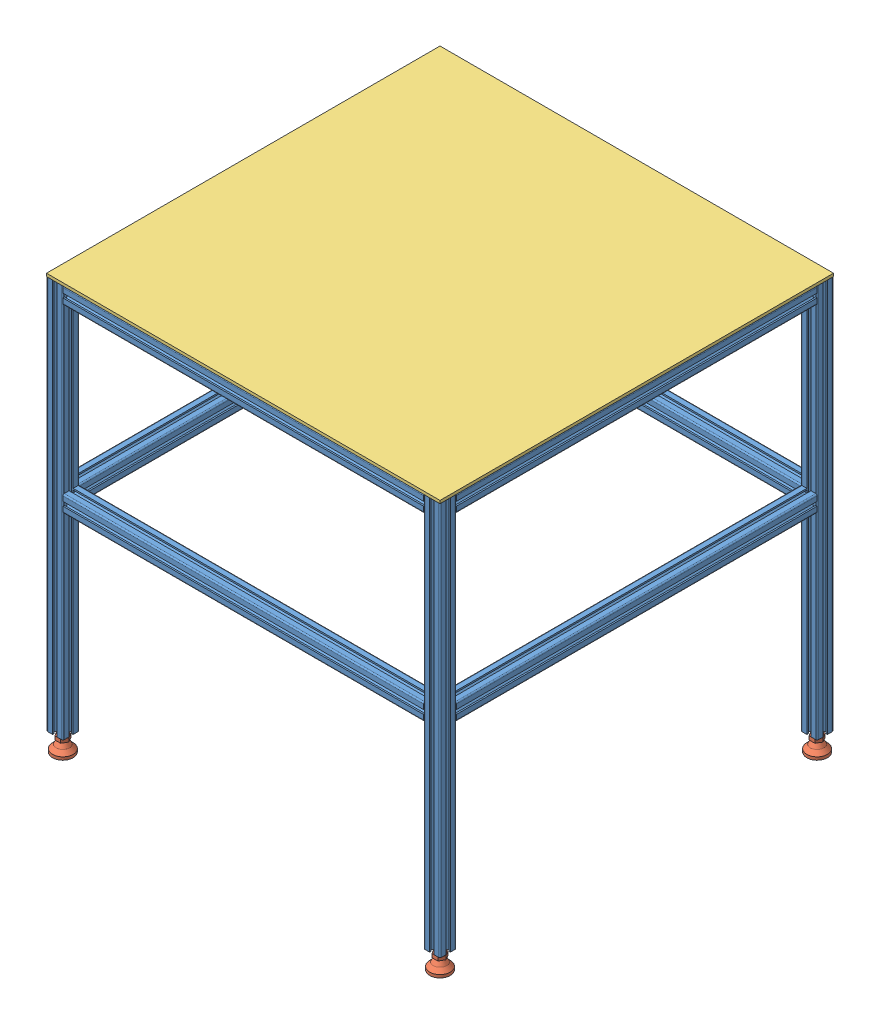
SolidWorks assembly 10-10 Table (with leveling feet).sldasm, configuration Default (file format 4700). Lengths in mm.
Overall size (615.95 642.21 615.95).
21 component instances, 3 part files, 51 mates.
Components (placement in the parent):
- 650000-15: 650000.sldprt [24] at (-596.9 -614.0958 -12.7) x (1 0 0) z (0 -1 0) size (25.4 25.4 609.6)
- 650000-16: 650000.sldprt [22] at (-584.2 -17.1958 -12.7) x (0 1 0) z (-1 0 0) size (25.4 25.4 558.8)
- 650000-17: 650000.sldprt [24] at (-12.7 -4.4958 -12.7) x (-1 0 0) z (0 1 0) size (25.4 25.4 609.6)
- 650000-18: 650000.sldprt [22] at (-12.7 -17.1958 -25.4) x (0 1 0) z (0 0 1) size (25.4 25.4 558.8)
- 650000-19: 650000.sldprt [22] at (-596.9 -17.1958 -25.4) x (0 1 0) z (0 0 1) size (25.4 25.4 558.8)
- 650000-20: 650000.sldprt [24] at (-12.7 -4.4958 -596.9) x (0 0 1) z (0 1 0) size (25.4 25.4 609.6)
- 650000-21: 650000.sldprt [24] at (-596.9 -4.4958 -596.9) x (0 0 1) z (0 1 0) size (25.4 25.4 609.6)
- 650000-24: 650000.sldprt [22] at (-25.4 -17.1958 -596.9) x (0 0 1) z (1 0 0) size (25.4 25.4 558.8)
- 650000-25: 650000.sldprt [22] at (-584.2 -296.5958 -12.7) x (0 -1 0) z (-1 0 0) size (25.4 25.4 558.8)
- 650000-26: 650000.sldprt [22] at (-596.9 -296.5958 -25.4) size (25.4 25.4 558.8)
- 650000-27: 650000.sldprt [22] at (-25.4 -296.5958 -596.9) x (0 0 1) z (1 0 0) size (25.4 25.4 558.8)
- 650000-28: 650000.sldprt [22] at (-12.7 -296.5958 -25.4) x (-1 0 0) z (0 0 1) size (25.4 25.4 558.8)
- 655634-1: 655634.sldasm [Default] at (-596.9 -642.2136 -12.7) size (31.75 73.66 31.75)
  - 655634-1: 655634.SLDPRT [Default] at origin size (31.75 73.66 31.75)
- 655634-2: 655634.sldasm [Default] at (-12.7 -642.2136 -12.7) size (31.75 73.66 31.75)
  - 655634-1: 655634.SLDPRT [Default] at origin size (31.75 73.66 31.75)
- 655634-3: 655634.sldasm [Default] at (-12.7 -642.2136 -596.9) size (31.75 73.66 31.75)
  - 655634-1: 655634.SLDPRT [Default] at origin size (31.75 73.66 31.75)
- 655634-4: 655634.sldasm [Default] at (-596.9 -642.2136 -596.9) size (31.75 73.66 31.75)
  - 655634-1: 655634.SLDPRT [Default] at origin size (31.75 73.66 31.75)
- 655433-1: 655433.sldprt [24x24] at (-609.6 0 -609.6) x (0 -1 0) z (-1 0 0) size (4.5 609.6 609.6)
Mates (geometry in assembly coordinates):
- Coincident50: coincident anti-aligned: plane of 650000-15; plane of 650000-16 through (12.7 -17.1958 -12.7) normal (-1 0 0)
- Coincident52: coincident aligned: plane of 650000-15; plane of 650000-16
- Coincident54: coincident anti-aligned: plane of 650000-15; plane of 650000-16
- Coincident56: coincident anti-aligned: plane of 650000-16 through (571.5 -17.1958 -12.7) normal (1 0 0); plane of 650000-17
- Coincident59: coincident anti-aligned: plane of 650000-16; plane of 650000-17 through (584.2 -4.4958 -12.7) normal (0 0 1)
- Coincident60: coincident aligned: plane of 650000-16 through (571.5 -4.4958 -15.9258) normal (0 1 0); plane of 650000-17 through (594.868 -4.4958 -23.368) normal (0 1 0)
- Coincident61: coincident anti-aligned: plane of 650000-17; plane of 650000-18 through (584.2 -17.1958 -25.4) normal (0 0 1)
- Coincident63: coincident aligned: plane of 650000-17 through (584.2 -4.4958 -12.7) normal (0 1 0); plane of 650000-18
- Coincident65: coincident aligned: plane of 650000-17; plane of 650000-18
- Coincident66: coincident anti-aligned: plane of 650000-15 through (0 -614.0958 -25.4) normal (0 0 -1); plane of 650000-19 through (0 -17.1958 -25.4) normal (0 0 1)
- Coincident68: coincident aligned: plane of 650000-15; plane of 650000-19
- Coincident70: coincident anti-aligned: plane of 650000-15; plane of 650000-19
- Coincident72: coincident anti-aligned: plane of 650000-18 through (584.2 -17.1958 -584.2) normal (0 0 -1); plane of 650000-20
- Coincident75: coincident anti-aligned: plane of 650000-18; plane of 650000-20
- Coincident76: coincident aligned: plane of 650000-18 through (587.4258 -4.4958 -584.2) normal (0 1 0); plane of 650000-20 through (573.532 -4.4958 -607.568) normal (0 1 0)
- Coincident78: coincident anti-aligned: plane of 650000-19 through (0 -17.1958 -584.2) normal (0 0 -1); plane of 650000-21
- Coincident81: coincident anti-aligned: plane of 650000-19; plane of 650000-21
- Coincident82: coincident aligned: plane of 650000-19 through (3.2258 -4.4958 -584.2) normal (0 1 0); plane of 650000-21 through (-10.668 -4.4958 -607.568) normal (0 1 0)
- Coincident90: coincident anti-aligned: plane of 650000-20; plane of 650000-24 through (571.5 -17.1958 -596.9) normal (1 0 0)
- Coincident91: coincident aligned: plane of 650000-20; plane of 650000-24
- Coincident92: coincident aligned: plane of 650000-20 through (573.532 -4.4958 -607.568) normal (0 1 0); plane of 650000-24 through (12.7 -4.4958 -593.6742) normal (0 1 0)
- Coincident93: coincident anti-aligned: plane of 650000-15; plane of 650000-25 through (12.7 -296.5958 -12.7) normal (-1 0 0)
- Coincident94: coincident aligned: plane of 650000-15; plane of 650000-25
- Coincident95: coincident anti-aligned: plane of 650000-15 through (0 -614.0958 -25.4) normal (0 0 -1); plane of 650000-26 through (0 -296.5958 -25.4) normal (0 0 1)
- Coincident96: coincident aligned: plane of 650000-15; plane of 650000-26 through (0 -296.5958 -25.4) normal (1 0 0)
- Coincident97: coincident anti-aligned: plane of 650000-20; plane of 650000-27 through (571.5 -296.5958 -596.9) normal (1 0 0)
- Coincident98: coincident aligned: plane of 650000-20; plane of 650000-27
- Coincident99: coincident anti-aligned: plane of 650000-17; plane of 650000-28 through (584.2 -296.5958 -25.4) normal (0 0 1)
- Coincident100: coincident aligned: plane of 650000-17; plane of 650000-28
- Distance5: distance = 304.8 mm aligned: plane of 650000-28 through (-9.4742 -309.2958 -584.2) normal (0 -1 0); plane of 650000-17 through (-2.032 -614.0958 -23.368) normal (0 -1 0)
- Distance6: distance = 304.8 mm aligned: plane of 650000-27 through (-584.2 -309.2958 -600.1258) normal (0 -1 0); plane of 650000-20 through (-23.368 -614.0958 -607.568) normal (0 -1 0)
- Distance7: distance = 304.8 mm aligned: plane of 650000-26 through (-593.6742 -309.2958 -584.2) normal (0 -1 0); plane of 650000-21 through (-607.568 -614.0958 -607.568) normal (0 -1 0)
- Distance8: distance = 304.8 mm aligned: plane of 650000-25 through (-25.4 -309.2958 -9.4742) normal (0 -1 0); plane of 650000-15 through (-607.568 -614.0958 -23.368) normal (0 -1 0)
- Coincident108: coincident anti-aligned: plane of 650000-15 through (0 -614.0958 -12.7) normal (0 -1 0); plane of 655634-1 through (0 -614.0958 -12.7) normal (0 1 0)
- Coincident109: coincident anti-aligned: plane of 650000-15; line of 655634-1 through (0 -568.5536 -12.7) axis (0 -1 0)
- Coincident110: coincident anti-aligned: plane of 650000-15; line of 655634-1 through (0 -568.5536 -12.7) axis (0 -1 0)
- Coincident111: coincident anti-aligned: plane of 650000-17; plane of 655634-2 through (584.2 -614.0958 -12.7) normal (0 1 0)
- Coincident112: coincident anti-aligned: plane of 650000-17 through (584.2 -4.4958 -12.7) normal (0 0 1); line of 655634-2 through (584.2 -568.5536 -12.7) axis (0 -1 0)
- Coincident113: coincident anti-aligned: plane of 650000-17; line of 655634-2 through (584.2 -568.5536 -12.7) axis (0 -1 0)
- Coincident114: coincident anti-aligned: plane of 650000-20; plane of 655634-3 through (584.2 -614.0958 -596.9) normal (0 1 0)
- Coincident115: coincident anti-aligned: plane of 650000-20; line of 655634-3 through (584.2 -568.5536 -596.9) axis (0 -1 0)
- Coincident116: coincident anti-aligned: plane of 650000-20; line of 655634-3 through (584.2 -568.5536 -596.9) axis (0 -1 0)
- Coincident117: coincident anti-aligned: plane of 650000-21; plane of 655634-4 through (0 -614.0958 -596.9) normal (0 1 0)
- Coincident118: coincident anti-aligned: plane of 650000-21; line of 655634-4 through (0 -568.5536 -596.9) axis (0 -1 0)
- Coincident119: coincident anti-aligned: plane of 650000-21; line of 655634-4 through (0 -568.5536 -596.9) axis (0 -1 0)
- Coincident120: coincident anti-aligned: plane of 650000-19 through (3.2258 -4.4958 -584.2) normal (0 1 0); plane of 655433-1 through (-12.7 -4.4958 0) normal (0 -1 0)
- Coincident121: coincident aligned: plane of 650000-24 through (12.7 -13.97 -609.6) normal (0 0 -1); plane of 655433-1 through (-12.7 -4.4958 -609.6) normal (0 0 -1)
- Coincident122: coincident aligned: plane of 650000-19 through (-12.7 -13.97 -584.2) normal (-1 0 0); plane of 655433-1 through (-12.7 -4.4958 -609.6) normal (-1 0 0)
- Coincident123: coincident aligned: plane of 655433-1 through (-609.6 0 0) normal (0 1 0); plane of assembly
- Coincident124: coincident aligned: plane of 650000-16 through (-25.4 -20.4216 0) normal (0 0 1); plane of assembly
- Coincident125: coincident aligned: plane of 650000-18 through (0 -20.4216 -584.2) normal (1 0 0); plane of assembly
